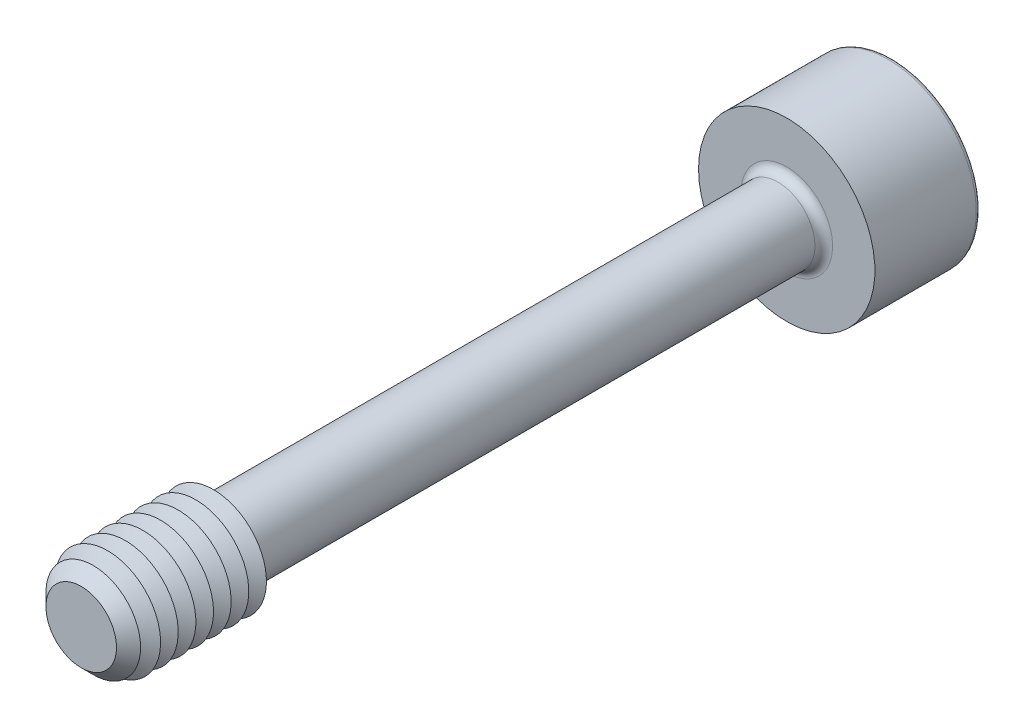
from build123d import *

# Parameters (mm, degrees)
SKETCH1_R       = 2.1
EXTRUDE1_DEPTH  = 20
CHAMFER1_SIZE   = 1
SKETCH3_R       = 5
EXTRUDE2_DEPTH  = 6
EXTRUDE3_DEPTH  = 5
FILLET1_R       = 0.5
FILLET2_R       = 0.25
LPATTERN1_COUNT = 7
LPATTERN1_PITCH = 1


with BuildPart() as part:
    # Sketch1 → Extrude1 (new, symmetric)
    with BuildSketch(Plane.XY):
        Circle(SKETCH1_R)
    extrude(amount=EXTRUDE1_DEPTH, both=True)

    # Sketch2 → Revolve1 (revolve)
    with BuildSketch(Plane(origin=(0, 0, 0), x_dir=(0, 0, -1), z_dir=(1, 0, 0))):
        Polygon((-20, 0), (-20, 3), (-12.5, 3), (-11.980384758, 2.1), (-11.980384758, 0), align=None)
    revolve(axis=Axis((0, 0, 11.980384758), (0, 0, 1)))

    # Chamfer1
    chamfer1_edges = [part.edges().sort_by_distance(p)[0] for p in [
        (0, -3, 20),
    ]]
    chamfer(chamfer1_edges, length=CHAMFER1_SIZE)

    # Sketch3 → Extrude2 (add)
    with BuildSketch(Plane(origin=(0, 0, -20), x_dir=(-1, 0, 0), z_dir=(0, 0, -1))):
        Circle(SKETCH3_R)
    extrude(amount=EXTRUDE2_DEPTH)

    # Sketch4 → Extrude3 (cut)
    with BuildSketch(Plane(origin=(-13.7, 0, -26), x_dir=(1, 0, 0), z_dir=(0, 0, 1))):
        Polygon((12.256624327, -2.5), (15.143375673, -2.5), (16.586751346, 0), (15.143375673, 2.5), (12.256624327, 2.5), (10.813248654, 0), align=None)
    extrude(amount=EXTRUDE3_DEPTH, mode=Mode.SUBTRACT)

    # Fillet1
    fillet1_edges = [part.edges().sort_by_distance(p)[0] for p in [
        (-2.1, 0, -20),
    ]]
    fillet(fillet1_edges, radius=FILLET1_R)

    # Fillet2
    fillet2_edges = [part.edges().sort_by_distance(p)[0] for p in [
        (5, 0, -26),
    ]]
    fillet(fillet2_edges, radius=FILLET2_R)

    # Sketch5 → Cut-Revolve1 (revolve, cut)
    with BuildSketch(Plane(origin=(0, 0, 0), x_dir=(0, 0, -1), z_dir=(1, 0, 0)), mode=Mode.PRIVATE) as cut_revolve1_sk:
        Polygon((21, 0), (21, -2.5), (19.556624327, 0), align=None)
    revolve(cut_revolve1_sk.sketch.rotate(Axis((0, 0, -19.556624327), (0, 0, -1)), 90), axis=Axis((0, 0, -19.556624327), (0, 0, -1)), mode=Mode.SUBTRACT)

    # Sketch7 → Cut-Revolve2 (revolve, cut)
    with BuildSketch(Plane(origin=(0, 0, 0), x_dir=(0, 0, -1), z_dir=(1, 0, 0)), mode=Mode.PRIVATE) as cut_revolve2_sk:
        Polygon((-12.5, 3), (-13, 2.133974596), (-13.5, 3), align=None)
    cut_revolve2 = revolve(cut_revolve2_sk.sketch.rotate(Axis((0, 0, -1.332048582), (0, 0, 1)), 90), axis=Axis((0, 0, -1.332048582), (0, 0, 1)), mode=Mode.SUBTRACT)

    # LPattern1: Cut-Revolve2 ×7
    with Locations(*[(0, 0, i * LPATTERN1_PITCH) for i in range(1, LPATTERN1_COUNT)]):
        add(cut_revolve2, mode=Mode.SUBTRACT)


solid = part.part
